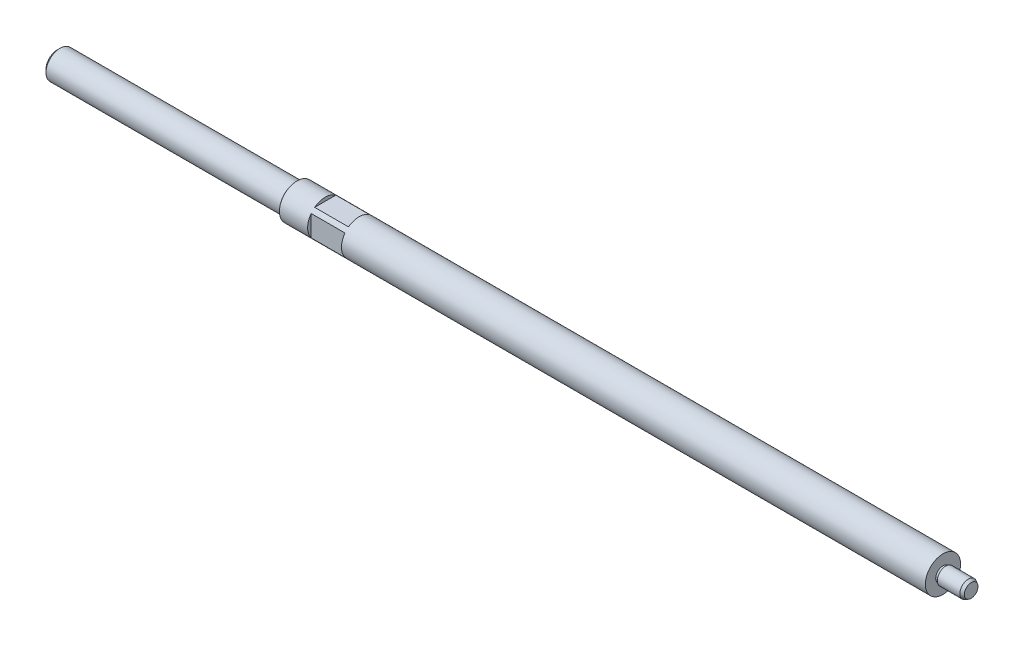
ISO-10303-21;
HEADER;
FILE_DESCRIPTION(('STEP AP214'),'2;1');
FILE_NAME('part.step','',(''),(''),'','','');
FILE_SCHEMA(('AUTOMOTIVE_DESIGN { 1 0 10303 214 1 1 1 1 }'));
ENDSEC;
DATA;
#1=APPLICATION_CONTEXT('core data for automotive mechanical design processes');
#2=APPLICATION_PROTOCOL_DEFINITION('international standard','automotive_design',2000,#1);
#3=PRODUCT_CONTEXT('',#1,'mechanical');
#4=PRODUCT('Part','Part','',(#3));
#5=PRODUCT_RELATED_PRODUCT_CATEGORY('part','',(#4));
#6=PRODUCT_DEFINITION_FORMATION('','',#4);
#7=PRODUCT_DEFINITION_CONTEXT('part definition',#1,'design');
#8=PRODUCT_DEFINITION('design','',#6,#7);
#9=PRODUCT_DEFINITION_SHAPE('','',#8);
#10=(LENGTH_UNIT() NAMED_UNIT(*) SI_UNIT(.MILLI.,.METRE.));
#11=(NAMED_UNIT(*) PLANE_ANGLE_UNIT() SI_UNIT($,.RADIAN.));
#12=(NAMED_UNIT(*) SI_UNIT($,.STERADIAN.) SOLID_ANGLE_UNIT());
#13=UNCERTAINTY_MEASURE_WITH_UNIT(LENGTH_MEASURE(1.E-05),#10,'distance_accuracy_value','');
#14=(GEOMETRIC_REPRESENTATION_CONTEXT(3) GLOBAL_UNCERTAINTY_ASSIGNED_CONTEXT((#13)) GLOBAL_UNIT_ASSIGNED_CONTEXT((#10,
#11,#12)) REPRESENTATION_CONTEXT('',''));
#15=CARTESIAN_POINT('',(0.,0.,0.));
#16=DIRECTION('',(0.,0.,1.));
#17=DIRECTION('',(1.,0.,0.));
#18=AXIS2_PLACEMENT_3D('',#15,#16,#17);
#19=CARTESIAN_POINT('',(33.2838037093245,0.,0.));
#20=DIRECTION('',(1.,0.,0.));
#21=DIRECTION('',(0.,0.,-1.));
#22=AXIS2_PLACEMENT_3D('',#19,#20,#21);
#23=CYLINDRICAL_SURFACE('',#22,12.5);
#24=CARTESIAN_POINT('',(-434.,0.,0.));
#25=DIRECTION('',(1.,0.,0.));
#26=DIRECTION('',(0.,0.,-1.));
#27=AXIS2_PLACEMENT_3D('',#24,#25,#26);
#28=CIRCLE('',#27,12.5);
#29=CARTESIAN_POINT('',(-434.,-7.49999999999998,10.));
#30=VERTEX_POINT('',#29);
#31=CARTESIAN_POINT('',(-434.,7.50000000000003,10.));
#32=VERTEX_POINT('',#31);
#33=EDGE_CURVE('E91',#30,#32,#28,.F.);
#34=ORIENTED_EDGE('',*,*,#33,.F.);
#35=DIRECTION('',(1.,0.,0.));
#36=VECTOR('',#35,1.);
#37=CARTESIAN_POINT('',(33.2838037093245,-7.50000000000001,10.));
#38=LINE('',#37,#36);
#39=CARTESIAN_POINT('',(-458.,-7.49999999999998,10.));
#40=VERTEX_POINT('',#39);
#41=EDGE_CURVE('E13',#40,#30,#38,.T.);
#42=ORIENTED_EDGE('',*,*,#41,.F.);
#43=CARTESIAN_POINT('',(-458.,0.,0.));
#44=DIRECTION('',(-1.,0.,0.));
#45=DIRECTION('',(0.,0.,1.));
#46=AXIS2_PLACEMENT_3D('',#43,#44,#45);
#47=CIRCLE('',#46,12.5);
#48=CARTESIAN_POINT('',(-458.,7.50000000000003,10.));
#49=VERTEX_POINT('',#48);
#50=EDGE_CURVE('E32',#49,#40,#47,.F.);
#51=ORIENTED_EDGE('',*,*,#50,.F.);
#52=DIRECTION('',(1.,0.,0.));
#53=VECTOR('',#52,1.);
#54=CARTESIAN_POINT('',(33.2838037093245,7.50000000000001,10.));
#55=LINE('',#54,#53);
#56=EDGE_CURVE('E94',#32,#49,#55,.F.);
#57=ORIENTED_EDGE('',*,*,#56,.F.);
#58=EDGE_LOOP('',(#34,#42,#51,#57));
#59=FACE_BOUND('',#58,.T.);
#60=DIRECTION('',(1.,0.,0.));
#61=VECTOR('',#60,1.);
#62=CARTESIAN_POINT('',(33.2838037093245,-7.50000000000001,-10.));
#63=LINE('',#62,#61);
#64=CARTESIAN_POINT('',(-434.,-7.49999999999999,-9.99999999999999));
#65=VERTEX_POINT('',#64);
#66=CARTESIAN_POINT('',(-458.,-7.49999999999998,-9.99999999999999));
#67=VERTEX_POINT('',#66);
#68=EDGE_CURVE('E98',#65,#67,#63,.F.);
#69=ORIENTED_EDGE('',*,*,#68,.F.);
#70=CARTESIAN_POINT('',(-434.,0.,0.));
#71=DIRECTION('',(1.,0.,0.));
#72=DIRECTION('',(0.,0.,-1.));
#73=AXIS2_PLACEMENT_3D('',#70,#71,#72);
#74=CIRCLE('',#73,12.5);
#75=CARTESIAN_POINT('',(-434.,7.50000000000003,-10.));
#76=VERTEX_POINT('',#75);
#77=EDGE_CURVE('E182',#76,#65,#74,.F.);
#78=ORIENTED_EDGE('',*,*,#77,.F.);
#79=DIRECTION('',(1.,0.,0.));
#80=VECTOR('',#79,1.);
#81=CARTESIAN_POINT('',(33.2838037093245,7.50000000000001,-10.));
#82=LINE('',#81,#80);
#83=CARTESIAN_POINT('',(-458.,7.50000000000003,-9.99999999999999));
#84=VERTEX_POINT('',#83);
#85=EDGE_CURVE('E180',#84,#76,#82,.T.);
#86=ORIENTED_EDGE('',*,*,#85,.F.);
#87=CARTESIAN_POINT('',(-458.,0.,0.));
#88=DIRECTION('',(-1.,0.,0.));
#89=DIRECTION('',(0.,0.,1.));
#90=AXIS2_PLACEMENT_3D('',#87,#88,#89);
#91=CIRCLE('',#90,12.5);
#92=EDGE_CURVE('E184',#67,#84,#91,.F.);
#93=ORIENTED_EDGE('',*,*,#92,.F.);
#94=EDGE_LOOP('',(#69,#78,#86,#93));
#95=FACE_BOUND('',#94,.T.);
#96=CARTESIAN_POINT('',(-478.,0.,0.));
#97=DIRECTION('',(1.,0.,0.));
#98=DIRECTION('',(0.,0.,-1.));
#99=AXIS2_PLACEMENT_3D('',#96,#97,#98);
#100=CIRCLE('',#99,12.5);
#101=CARTESIAN_POINT('',(-478.,0.,-12.5));
#102=VERTEX_POINT('',#101);
#103=EDGE_CURVE('E124',#102,#102,#100,.T.);
#104=ORIENTED_EDGE('',*,*,#103,.T.);
#105=EDGE_LOOP('',(#104));
#106=FACE_BOUND('',#105,.T.);
#107=CARTESIAN_POINT('',(-20.,0.,0.));
#108=DIRECTION('',(1.,0.,0.));
#109=DIRECTION('',(0.,0.,-1.));
#110=AXIS2_PLACEMENT_3D('',#107,#108,#109);
#111=CIRCLE('',#110,12.5);
#112=CARTESIAN_POINT('',(-20.,0.,-12.5));
#113=VERTEX_POINT('',#112);
#114=EDGE_CURVE('E127',#113,#113,#111,.T.);
#115=ORIENTED_EDGE('',*,*,#114,.F.);
#116=EDGE_LOOP('',(#115));
#117=FACE_BOUND('',#116,.T.);
#118=DIRECTION('',(1.,0.,0.));
#119=VECTOR('',#118,1.);
#120=CARTESIAN_POINT('',(33.2838037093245,10.,-7.50000000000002));
#121=LINE('',#120,#119);
#122=CARTESIAN_POINT('',(-458.,10.,-7.50000000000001));
#123=VERTEX_POINT('',#122);
#124=CARTESIAN_POINT('',(-434.,10.,-7.49999999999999));
#125=VERTEX_POINT('',#124);
#126=EDGE_CURVE('E160',#123,#125,#121,.T.);
#127=ORIENTED_EDGE('',*,*,#126,.T.);
#128=CARTESIAN_POINT('',(-434.,0.,0.));
#129=DIRECTION('',(-1.,0.,0.));
#130=DIRECTION('',(0.,0.,1.));
#131=AXIS2_PLACEMENT_3D('',#128,#129,#130);
#132=CIRCLE('',#131,12.5);
#133=CARTESIAN_POINT('',(-434.,10.,7.50000000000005));
#134=VERTEX_POINT('',#133);
#135=EDGE_CURVE('E151',#125,#134,#132,.F.);
#136=ORIENTED_EDGE('',*,*,#135,.T.);
#137=DIRECTION('',(1.,0.,0.));
#138=VECTOR('',#137,1.);
#139=CARTESIAN_POINT('',(33.2838037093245,10.,7.50000000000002));
#140=LINE('',#139,#138);
#141=CARTESIAN_POINT('',(-458.,10.,7.50000000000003));
#142=VERTEX_POINT('',#141);
#143=EDGE_CURVE('E154',#134,#142,#140,.F.);
#144=ORIENTED_EDGE('',*,*,#143,.T.);
#145=CARTESIAN_POINT('',(-458.,0.,0.));
#146=DIRECTION('',(1.,0.,0.));
#147=DIRECTION('',(0.,0.,-1.));
#148=AXIS2_PLACEMENT_3D('',#145,#146,#147);
#149=CIRCLE('',#148,12.5);
#150=EDGE_CURVE('E157',#142,#123,#149,.F.);
#151=ORIENTED_EDGE('',*,*,#150,.T.);
#152=EDGE_LOOP('',(#127,#136,#144,#151));
#153=FACE_BOUND('',#152,.T.);
#154=CARTESIAN_POINT('',(-434.,0.,0.));
#155=DIRECTION('',(-1.,0.,0.));
#156=DIRECTION('',(0.,0.,1.));
#157=AXIS2_PLACEMENT_3D('',#154,#155,#156);
#158=CIRCLE('',#157,12.5);
#159=CARTESIAN_POINT('',(-434.,-9.99999999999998,7.50000000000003));
#160=VERTEX_POINT('',#159);
#161=CARTESIAN_POINT('',(-434.,-9.99999999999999,-7.50000000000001));
#162=VERTEX_POINT('',#161);
#163=EDGE_CURVE('E166',#160,#162,#158,.F.);
#164=ORIENTED_EDGE('',*,*,#163,.T.);
#165=DIRECTION('',(1.,0.,0.));
#166=VECTOR('',#165,1.);
#167=CARTESIAN_POINT('',(33.2838037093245,-10.,-7.50000000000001));
#168=LINE('',#167,#166);
#169=CARTESIAN_POINT('',(-458.,-9.99999999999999,-7.49999999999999));
#170=VERTEX_POINT('',#169);
#171=EDGE_CURVE('E171',#162,#170,#168,.F.);
#172=ORIENTED_EDGE('',*,*,#171,.T.);
#173=CARTESIAN_POINT('',(-458.,0.,0.));
#174=DIRECTION('',(1.,0.,0.));
#175=DIRECTION('',(0.,0.,-1.));
#176=AXIS2_PLACEMENT_3D('',#173,#174,#175);
#177=CIRCLE('',#176,12.5);
#178=CARTESIAN_POINT('',(-458.,-9.99999999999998,7.50000000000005));
#179=VERTEX_POINT('',#178);
#180=EDGE_CURVE('E168',#170,#179,#177,.F.);
#181=ORIENTED_EDGE('',*,*,#180,.T.);
#182=DIRECTION('',(1.,0.,0.));
#183=VECTOR('',#182,1.);
#184=CARTESIAN_POINT('',(33.2838037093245,-10.,7.50000000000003));
#185=LINE('',#184,#183);
#186=EDGE_CURVE('E163',#179,#160,#185,.T.);
#187=ORIENTED_EDGE('',*,*,#186,.T.);
#188=EDGE_LOOP('',(#164,#172,#181,#187));
#189=FACE_BOUND('',#188,.T.);
#190=ADVANCED_FACE('F24',(#59,#95,#106,#117,#153,#189),#23,.T.);
#191=CARTESIAN_POINT('',(0.,0.,0.));
#192=DIRECTION('',(1.,0.,0.));
#193=DIRECTION('',(0.,0.,-1.));
#194=AXIS2_PLACEMENT_3D('',#191,#192,#193);
#195=PLANE('',#194);
#196=CARTESIAN_POINT('',(0.,0.,0.));
#197=DIRECTION('',(1.,0.,0.));
#198=DIRECTION('',(0.,0.,-1.));
#199=AXIS2_PLACEMENT_3D('',#196,#197,#198);
#200=CIRCLE('',#199,4.84529946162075);
#201=CARTESIAN_POINT('',(0.,0.,-4.84529946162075));
#202=VERTEX_POINT('',#201);
#203=EDGE_CURVE('E145',#202,#202,#200,.T.);
#204=ORIENTED_EDGE('',*,*,#203,.T.);
#205=EDGE_LOOP('',(#204));
#206=FACE_BOUND('',#205,.T.);
#207=ADVANCED_FACE('F203',(#206),#195,.T.);
#208=CARTESIAN_POINT('',(33.2838037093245,0.,0.));
#209=DIRECTION('',(1.,0.,0.));
#210=DIRECTION('',(0.,0.,-1.));
#211=AXIS2_PLACEMENT_3D('',#208,#209,#210);
#212=CYLINDRICAL_SURFACE('',#211,6.);
#213=CARTESIAN_POINT('',(-2.,0.,0.));
#214=DIRECTION('',(1.,0.,0.));
#215=DIRECTION('',(0.,0.,-1.));
#216=AXIS2_PLACEMENT_3D('',#213,#214,#215);
#217=CIRCLE('',#216,6.);
#218=CARTESIAN_POINT('',(-2.,0.,-6.00000000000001));
#219=VERTEX_POINT('',#218);
#220=EDGE_CURVE('E148',#219,#219,#217,.F.);
#221=ORIENTED_EDGE('',*,*,#220,.T.);
#222=EDGE_LOOP('',(#221));
#223=FACE_BOUND('',#222,.T.);
#224=CARTESIAN_POINT('',(-18.,0.,0.));
#225=DIRECTION('',(1.,0.,0.));
#226=DIRECTION('',(0.,0.,-1.));
#227=AXIS2_PLACEMENT_3D('',#224,#225,#226);
#228=CIRCLE('',#227,6.);
#229=CARTESIAN_POINT('',(-18.,0.,-6.00000000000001));
#230=VERTEX_POINT('',#229);
#231=EDGE_CURVE('E136',#230,#230,#228,.T.);
#232=ORIENTED_EDGE('',*,*,#231,.T.);
#233=EDGE_LOOP('',(#232));
#234=FACE_BOUND('',#233,.T.);
#235=ADVANCED_FACE('F208',(#223,#234),#212,.T.);
#236=CARTESIAN_POINT('',(-18.,6.00000000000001,0.));
#237=DIRECTION('',(-1.,0.,0.));
#238=DIRECTION('',(0.,0.,1.));
#239=AXIS2_PLACEMENT_3D('',#236,#237,#238);
#240=PLANE('',#239);
#241=CARTESIAN_POINT('',(-18.,0.,0.));
#242=DIRECTION('',(1.,0.,0.));
#243=DIRECTION('',(0.,0.,-1.));
#244=AXIS2_PLACEMENT_3D('',#241,#242,#243);
#245=CIRCLE('',#244,5.125);
#246=CARTESIAN_POINT('',(-18.,0.,-5.125));
#247=VERTEX_POINT('',#246);
#248=EDGE_CURVE('E133',#247,#247,#245,.T.);
#249=ORIENTED_EDGE('',*,*,#248,.T.);
#250=EDGE_LOOP('',(#249));
#251=FACE_BOUND('',#250,.T.);
#252=ORIENTED_EDGE('',*,*,#231,.F.);
#253=EDGE_LOOP('',(#252));
#254=FACE_BOUND('',#253,.T.);
#255=ADVANCED_FACE('F222',(#251,#254),#240,.T.);
#256=CARTESIAN_POINT('',(33.2838037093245,0.,0.));
#257=DIRECTION('',(1.,0.,0.));
#258=DIRECTION('',(0.,0.,-1.));
#259=AXIS2_PLACEMENT_3D('',#256,#257,#258);
#260=CYLINDRICAL_SURFACE('',#259,5.125);
#261=CARTESIAN_POINT('',(-20.,0.,0.));
#262=DIRECTION('',(1.,0.,0.));
#263=DIRECTION('',(0.,0.,-1.));
#264=AXIS2_PLACEMENT_3D('',#261,#262,#263);
#265=CIRCLE('',#264,5.125);
#266=CARTESIAN_POINT('',(-20.,0.,-5.12500000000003));
#267=VERTEX_POINT('',#266);
#268=EDGE_CURVE('E130',#267,#267,#265,.T.);
#269=ORIENTED_EDGE('',*,*,#268,.T.);
#270=EDGE_LOOP('',(#269));
#271=FACE_BOUND('',#270,.T.);
#272=ORIENTED_EDGE('',*,*,#248,.F.);
#273=EDGE_LOOP('',(#272));
#274=FACE_BOUND('',#273,.T.);
#275=ADVANCED_FACE('F218',(#271,#274),#260,.T.);
#276=CARTESIAN_POINT('',(-20.,5.125,0.));
#277=DIRECTION('',(1.,0.,0.));
#278=DIRECTION('',(0.,0.,-1.));
#279=AXIS2_PLACEMENT_3D('',#276,#277,#278);
#280=PLANE('',#279);
#281=ORIENTED_EDGE('',*,*,#114,.T.);
#282=EDGE_LOOP('',(#281));
#283=FACE_BOUND('',#282,.T.);
#284=ORIENTED_EDGE('',*,*,#268,.F.);
#285=EDGE_LOOP('',(#284));
#286=FACE_BOUND('',#285,.T.);
#287=ADVANCED_FACE('F215',(#283,#286),#280,.T.);
#288=CARTESIAN_POINT('',(-478.,12.5,0.));
#289=DIRECTION('',(-1.,0.,0.));
#290=DIRECTION('',(0.,0.,1.));
#291=AXIS2_PLACEMENT_3D('',#288,#289,#290);
#292=PLANE('',#291);
#293=CARTESIAN_POINT('',(-478.,0.,0.));
#294=DIRECTION('',(-1.,0.,0.));
#295=DIRECTION('',(0.,0.,1.));
#296=AXIS2_PLACEMENT_3D('',#293,#294,#295);
#297=CIRCLE('',#296,12.);
#298=CARTESIAN_POINT('',(-478.,0.,12.));
#299=VERTEX_POINT('',#298);
#300=EDGE_CURVE('E174',#299,#299,#297,.F.);
#301=ORIENTED_EDGE('',*,*,#300,.T.);
#302=EDGE_LOOP('',(#301));
#303=FACE_BOUND('',#302,.T.);
#304=ORIENTED_EDGE('',*,*,#103,.F.);
#305=EDGE_LOOP('',(#304));
#306=FACE_BOUND('',#305,.T.);
#307=ADVANCED_FACE('F213',(#303,#306),#292,.T.);
#308=CARTESIAN_POINT('',(33.2838037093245,0.,0.));
#309=DIRECTION('',(1.,0.,0.));
#310=DIRECTION('',(0.,0.,-1.));
#311=AXIS2_PLACEMENT_3D('',#308,#309,#310);
#312=CYLINDRICAL_SURFACE('',#311,10.);
#313=CARTESIAN_POINT('',(-480.,0.,0.));
#314=DIRECTION('',(-1.,0.,0.));
#315=DIRECTION('',(0.,0.,1.));
#316=AXIS2_PLACEMENT_3D('',#313,#314,#315);
#317=CIRCLE('',#316,10.);
#318=CARTESIAN_POINT('',(-480.,0.,10.));
#319=VERTEX_POINT('',#318);
#320=EDGE_CURVE('E177',#319,#319,#317,.T.);
#321=ORIENTED_EDGE('',*,*,#320,.T.);
#322=EDGE_LOOP('',(#321));
#323=FACE_BOUND('',#322,.T.);
#324=CARTESIAN_POINT('',(-646.,0.,0.));
#325=DIRECTION('',(-1.,0.,0.));
#326=DIRECTION('',(0.,0.,1.));
#327=AXIS2_PLACEMENT_3D('',#324,#325,#326);
#328=CIRCLE('',#327,10.);
#329=CARTESIAN_POINT('',(-646.,0.,10.));
#330=VERTEX_POINT('',#329);
#331=EDGE_CURVE('E139',#330,#330,#328,.F.);
#332=ORIENTED_EDGE('',*,*,#331,.T.);
#333=EDGE_LOOP('',(#332));
#334=FACE_BOUND('',#333,.T.);
#335=ADVANCED_FACE('F259',(#323,#334),#312,.T.);
#336=CARTESIAN_POINT('',(-648.,10.,0.));
#337=DIRECTION('',(-1.,0.,0.));
#338=DIRECTION('',(0.,0.,1.));
#339=AXIS2_PLACEMENT_3D('',#336,#337,#338);
#340=PLANE('',#339);
#341=CARTESIAN_POINT('',(-648.,0.,0.));
#342=DIRECTION('',(-1.,0.,0.));
#343=DIRECTION('',(0.,0.,1.));
#344=AXIS2_PLACEMENT_3D('',#341,#342,#343);
#345=CIRCLE('',#344,8.);
#346=CARTESIAN_POINT('',(-648.,0.,8.00000000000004));
#347=VERTEX_POINT('',#346);
#348=EDGE_CURVE('E142',#347,#347,#345,.T.);
#349=ORIENTED_EDGE('',*,*,#348,.T.);
#350=EDGE_LOOP('',(#349));
#351=FACE_BOUND('',#350,.T.);
#352=ADVANCED_FACE('F233',(#351),#340,.T.);
#353=CARTESIAN_POINT('',(-646.,0.,0.));
#354=DIRECTION('',(1.,0.,0.));
#355=DIRECTION('',(0.,0.,-1.));
#356=AXIS2_PLACEMENT_3D('',#353,#354,#355);
#357=CONICAL_SURFACE('',#356,10.,0.785398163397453);
#358=ORIENTED_EDGE('',*,*,#348,.F.);
#359=EDGE_LOOP('',(#358));
#360=FACE_BOUND('',#359,.T.);
#361=ORIENTED_EDGE('',*,*,#331,.F.);
#362=EDGE_LOOP('',(#361));
#363=FACE_BOUND('',#362,.T.);
#364=ADVANCED_FACE('F230',(#360,#363),#357,.T.);
#365=CARTESIAN_POINT('',(0.,0.,0.));
#366=DIRECTION('',(-1.,0.,0.));
#367=DIRECTION('',(0.,0.,1.));
#368=AXIS2_PLACEMENT_3D('',#365,#366,#367);
#369=CONICAL_SURFACE('',#368,4.84529946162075,0.523598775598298);
#370=ORIENTED_EDGE('',*,*,#220,.F.);
#371=EDGE_LOOP('',(#370));
#372=FACE_BOUND('',#371,.T.);
#373=ORIENTED_EDGE('',*,*,#203,.F.);
#374=EDGE_LOOP('',(#373));
#375=FACE_BOUND('',#374,.T.);
#376=ADVANCED_FACE('F232',(#372,#375),#369,.T.);
#377=CARTESIAN_POINT('',(-458.,12.5,12.5000000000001));
#378=DIRECTION('',(1.,0.,0.));
#379=DIRECTION('',(0.,0.,-1.));
#380=AXIS2_PLACEMENT_3D('',#377,#378,#379);
#381=PLANE('',#380);
#382=DIRECTION('',(0.,0.,-1.));
#383=VECTOR('',#382,1.);
#384=CARTESIAN_POINT('',(-458.,10.,12.5));
#385=LINE('',#384,#383);
#386=EDGE_CURVE('E121',#142,#123,#385,.T.);
#387=ORIENTED_EDGE('',*,*,#386,.T.);
#388=ORIENTED_EDGE('',*,*,#150,.F.);
#389=EDGE_LOOP('',(#387,#388));
#390=FACE_BOUND('',#389,.T.);
#391=ADVANCED_FACE('F236',(#390),#381,.T.);
#392=CARTESIAN_POINT('',(-458.,10.,12.5));
#393=DIRECTION('',(0.,1.,0.));
#394=DIRECTION('',(0.,0.,1.));
#395=AXIS2_PLACEMENT_3D('',#392,#393,#394);
#396=PLANE('',#395);
#397=DIRECTION('',(0.,0.,-1.));
#398=VECTOR('',#397,1.);
#399=CARTESIAN_POINT('',(-434.,10.,12.5000000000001));
#400=LINE('',#399,#398);
#401=EDGE_CURVE('E118',#134,#125,#400,.T.);
#402=ORIENTED_EDGE('',*,*,#401,.T.);
#403=ORIENTED_EDGE('',*,*,#126,.F.);
#404=ORIENTED_EDGE('',*,*,#386,.F.);
#405=ORIENTED_EDGE('',*,*,#143,.F.);
#406=EDGE_LOOP('',(#402,#403,#404,#405));
#407=FACE_BOUND('',#406,.T.);
#408=ADVANCED_FACE('F241',(#407),#396,.T.);
#409=CARTESIAN_POINT('',(-434.,12.5,12.5));
#410=DIRECTION('',(-1.,0.,0.));
#411=DIRECTION('',(0.,0.,1.));
#412=AXIS2_PLACEMENT_3D('',#409,#410,#411);
#413=PLANE('',#412);
#414=ORIENTED_EDGE('',*,*,#401,.F.);
#415=ORIENTED_EDGE('',*,*,#135,.F.);
#416=EDGE_LOOP('',(#414,#415));
#417=FACE_BOUND('',#416,.T.);
#418=ADVANCED_FACE('F253',(#417),#413,.T.);
#419=CARTESIAN_POINT('',(-458.,-9.99999999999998,12.5000000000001));
#420=DIRECTION('',(1.,0.,0.));
#421=DIRECTION('',(0.,0.,-1.));
#422=AXIS2_PLACEMENT_3D('',#419,#420,#421);
#423=PLANE('',#422);
#424=DIRECTION('',(0.,0.,-1.));
#425=VECTOR('',#424,1.);
#426=CARTESIAN_POINT('',(-458.,-9.99999999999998,12.5000000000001));
#427=LINE('',#426,#425);
#428=EDGE_CURVE('E113',#179,#170,#427,.T.);
#429=ORIENTED_EDGE('',*,*,#428,.F.);
#430=ORIENTED_EDGE('',*,*,#180,.F.);
#431=EDGE_LOOP('',(#429,#430));
#432=FACE_BOUND('',#431,.T.);
#433=ADVANCED_FACE('F289',(#432),#423,.T.);
#434=CARTESIAN_POINT('',(-434.,-9.99999999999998,12.5));
#435=DIRECTION('',(-1.,0.,0.));
#436=DIRECTION('',(0.,0.,1.));
#437=AXIS2_PLACEMENT_3D('',#434,#435,#436);
#438=PLANE('',#437);
#439=DIRECTION('',(0.,0.,-1.));
#440=VECTOR('',#439,1.);
#441=CARTESIAN_POINT('',(-434.,-9.99999999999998,12.5));
#442=LINE('',#441,#440);
#443=EDGE_CURVE('E47',#160,#162,#442,.T.);
#444=ORIENTED_EDGE('',*,*,#443,.T.);
#445=ORIENTED_EDGE('',*,*,#163,.F.);
#446=EDGE_LOOP('',(#444,#445));
#447=FACE_BOUND('',#446,.T.);
#448=ADVANCED_FACE('F287',(#447),#438,.T.);
#449=CARTESIAN_POINT('',(-458.,-9.99999999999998,12.5000000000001));
#450=DIRECTION('',(0.,-1.,0.));
#451=DIRECTION('',(0.,0.,-1.));
#452=AXIS2_PLACEMENT_3D('',#449,#450,#451);
#453=PLANE('',#452);
#454=ORIENTED_EDGE('',*,*,#443,.F.);
#455=ORIENTED_EDGE('',*,*,#186,.F.);
#456=ORIENTED_EDGE('',*,*,#428,.T.);
#457=ORIENTED_EDGE('',*,*,#171,.F.);
#458=EDGE_LOOP('',(#454,#455,#456,#457));
#459=FACE_BOUND('',#458,.T.);
#460=ADVANCED_FACE('F276',(#459),#453,.T.);
#461=CARTESIAN_POINT('',(-480.,0.,0.));
#462=DIRECTION('',(-1.,0.,0.));
#463=DIRECTION('',(0.,0.,1.));
#464=AXIS2_PLACEMENT_3D('',#461,#462,#463);
#465=TOROIDAL_SURFACE('',#464,12.,2.);
#466=ORIENTED_EDGE('',*,*,#320,.F.);
#467=EDGE_LOOP('',(#466));
#468=FACE_BOUND('',#467,.T.);
#469=ORIENTED_EDGE('',*,*,#300,.F.);
#470=EDGE_LOOP('',(#469));
#471=FACE_BOUND('',#470,.T.);
#472=ADVANCED_FACE('F26',(#468,#471),#465,.F.);
#473=CARTESIAN_POINT('',(-458.,-12.5,-12.5));
#474=DIRECTION('',(-1.,0.,0.));
#475=DIRECTION('',(0.,0.,1.));
#476=AXIS2_PLACEMENT_3D('',#473,#474,#475);
#477=PLANE('',#476);
#478=DIRECTION('',(0.,1.,0.));
#479=VECTOR('',#478,1.);
#480=CARTESIAN_POINT('',(-458.,-12.5,-9.99999999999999));
#481=LINE('',#480,#479);
#482=EDGE_CURVE('E39',#67,#84,#481,.T.);
#483=ORIENTED_EDGE('',*,*,#482,.F.);
#484=ORIENTED_EDGE('',*,*,#92,.T.);
#485=EDGE_LOOP('',(#483,#484));
#486=FACE_BOUND('',#485,.T.);
#487=ADVANCED_FACE('F275',(#486),#477,.F.);
#488=CARTESIAN_POINT('',(-434.,-12.5,-12.5));
#489=DIRECTION('',(1.,0.,0.));
#490=DIRECTION('',(0.,0.,-1.));
#491=AXIS2_PLACEMENT_3D('',#488,#489,#490);
#492=PLANE('',#491);
#493=ORIENTED_EDGE('',*,*,#77,.T.);
#494=DIRECTION('',(0.,1.,0.));
#495=VECTOR('',#494,1.);
#496=CARTESIAN_POINT('',(-434.,-12.5,-9.99999999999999));
#497=LINE('',#496,#495);
#498=EDGE_CURVE('E110',#65,#76,#497,.T.);
#499=ORIENTED_EDGE('',*,*,#498,.T.);
#500=EDGE_LOOP('',(#493,#499));
#501=FACE_BOUND('',#500,.T.);
#502=ADVANCED_FACE('F198',(#501),#492,.F.);
#503=CARTESIAN_POINT('',(-458.,-12.5,-9.99999999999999));
#504=DIRECTION('',(0.,0.,1.));
#505=DIRECTION('',(1.,0.,0.));
#506=AXIS2_PLACEMENT_3D('',#503,#504,#505);
#507=PLANE('',#506);
#508=ORIENTED_EDGE('',*,*,#68,.T.);
#509=ORIENTED_EDGE('',*,*,#482,.T.);
#510=ORIENTED_EDGE('',*,*,#85,.T.);
#511=ORIENTED_EDGE('',*,*,#498,.F.);
#512=EDGE_LOOP('',(#508,#509,#510,#511));
#513=FACE_BOUND('',#512,.T.);
#514=ADVANCED_FACE('F190',(#513),#507,.F.);
#515=CARTESIAN_POINT('',(-458.,-12.5,12.5));
#516=DIRECTION('',(-1.,0.,0.));
#517=DIRECTION('',(0.,0.,1.));
#518=AXIS2_PLACEMENT_3D('',#515,#516,#517);
#519=PLANE('',#518);
#520=ORIENTED_EDGE('',*,*,#50,.T.);
#521=DIRECTION('',(0.,1.,0.));
#522=VECTOR('',#521,1.);
#523=CARTESIAN_POINT('',(-458.,-12.5,10.));
#524=LINE('',#523,#522);
#525=EDGE_CURVE('E105',#40,#49,#524,.T.);
#526=ORIENTED_EDGE('',*,*,#525,.T.);
#527=EDGE_LOOP('',(#520,#526));
#528=FACE_BOUND('',#527,.T.);
#529=ADVANCED_FACE('F188',(#528),#519,.F.);
#530=CARTESIAN_POINT('',(-458.,-12.5,10.));
#531=DIRECTION('',(0.,0.,-1.));
#532=DIRECTION('',(-1.,0.,0.));
#533=AXIS2_PLACEMENT_3D('',#530,#531,#532);
#534=PLANE('',#533);
#535=ORIENTED_EDGE('',*,*,#56,.T.);
#536=ORIENTED_EDGE('',*,*,#525,.F.);
#537=ORIENTED_EDGE('',*,*,#41,.T.);
#538=DIRECTION('',(0.,1.,0.));
#539=VECTOR('',#538,1.);
#540=CARTESIAN_POINT('',(-434.,-12.5,10.));
#541=LINE('',#540,#539);
#542=EDGE_CURVE('E103',#30,#32,#541,.T.);
#543=ORIENTED_EDGE('',*,*,#542,.T.);
#544=EDGE_LOOP('',(#535,#536,#537,#543));
#545=FACE_BOUND('',#544,.T.);
#546=ADVANCED_FACE('F102',(#545),#534,.F.);
#547=CARTESIAN_POINT('',(-434.,-12.5,12.5000000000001));
#548=DIRECTION('',(1.,0.,0.));
#549=DIRECTION('',(0.,0.,-1.));
#550=AXIS2_PLACEMENT_3D('',#547,#548,#549);
#551=PLANE('',#550);
#552=ORIENTED_EDGE('',*,*,#542,.F.);
#553=ORIENTED_EDGE('',*,*,#33,.T.);
#554=EDGE_LOOP('',(#552,#553));
#555=FACE_BOUND('',#554,.T.);
#556=ADVANCED_FACE('F106',(#555),#551,.F.);
#557=CLOSED_SHELL('',(#190,#207,#235,#255,#275,#287,#307,#335,#352,#364,#376,#391,#408,#418,
#433,#448,#460,#472,#487,#502,#514,#529,#546,#556));
#558=MANIFOLD_SOLID_BREP('B1',#557);
#559=ADVANCED_BREP_SHAPE_REPRESENTATION('',(#18,#558),#14);
#560=SHAPE_DEFINITION_REPRESENTATION(#9,#559);
ENDSEC;
END-ISO-10303-21;
